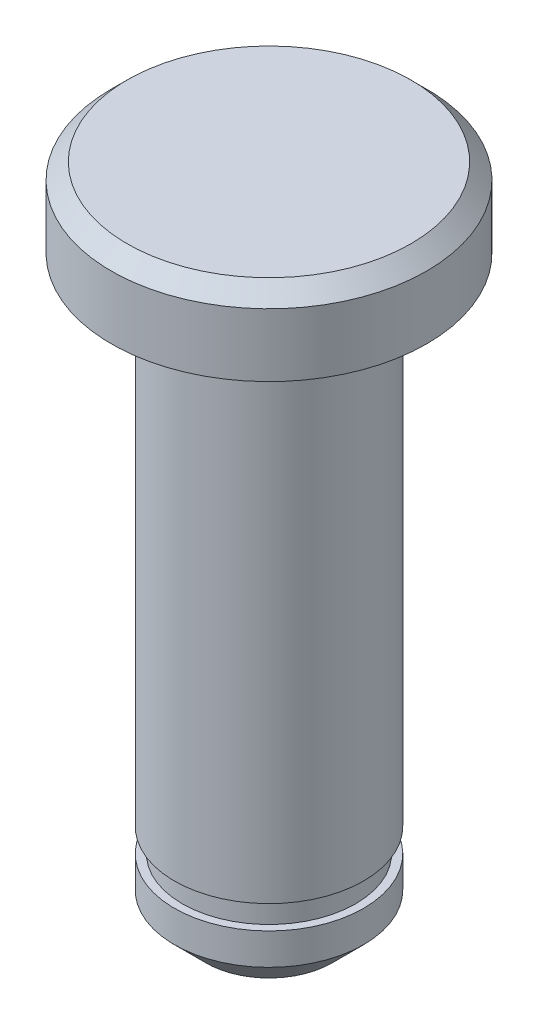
from build123d import *


with BuildPart() as part:
    # Esquisse1 → R_volution1 (revolve)
    with BuildSketch(Plane.XY):
        Polygon((4.5, 2.5), (0, 2.5), (0, -18.5), (2, -18.5), (3, -17.5), (3, -16.5), (2.75, -16.5), (2.75, -15.75), (3, -15.75), (3, 0), (5, 0), (5, 2), align=None)
    revolve(axis=Axis((0, 2.5, 0), (0, -1, 0)))


solid = part.part
